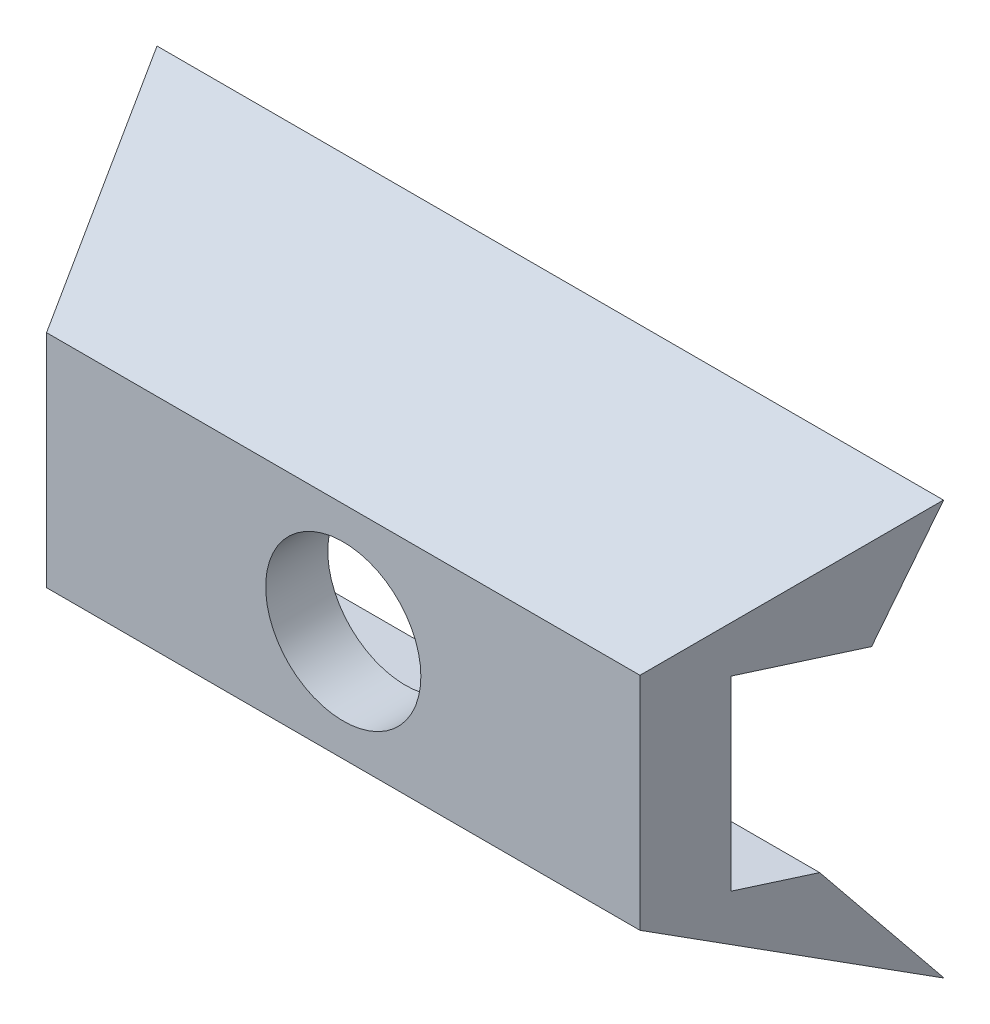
ISO-10303-21;
HEADER;
FILE_DESCRIPTION(('STEP AP214'),'2;1');
FILE_NAME('part.step','',(''),(''),'','','');
FILE_SCHEMA(('AUTOMOTIVE_DESIGN { 1 0 10303 214 1 1 1 1 }'));
ENDSEC;
DATA;
#1=APPLICATION_CONTEXT('core data for automotive mechanical design processes');
#2=APPLICATION_PROTOCOL_DEFINITION('international standard','automotive_design',2000,#1);
#3=PRODUCT_CONTEXT('',#1,'mechanical');
#4=PRODUCT('Part','Part','',(#3));
#5=PRODUCT_RELATED_PRODUCT_CATEGORY('part','',(#4));
#6=PRODUCT_DEFINITION_FORMATION('','',#4);
#7=PRODUCT_DEFINITION_CONTEXT('part definition',#1,'design');
#8=PRODUCT_DEFINITION('design','',#6,#7);
#9=PRODUCT_DEFINITION_SHAPE('','',#8);
#10=(LENGTH_UNIT() NAMED_UNIT(*) SI_UNIT(.MILLI.,.METRE.));
#11=(NAMED_UNIT(*) PLANE_ANGLE_UNIT() SI_UNIT($,.RADIAN.));
#12=(NAMED_UNIT(*) SI_UNIT($,.STERADIAN.) SOLID_ANGLE_UNIT());
#13=UNCERTAINTY_MEASURE_WITH_UNIT(LENGTH_MEASURE(1.E-05),#10,'distance_accuracy_value','');
#14=(GEOMETRIC_REPRESENTATION_CONTEXT(3) GLOBAL_UNCERTAINTY_ASSIGNED_CONTEXT((#13)) GLOBAL_UNIT_ASSIGNED_CONTEXT((#10,
#11,#12)) REPRESENTATION_CONTEXT('',''));
#15=CARTESIAN_POINT('',(0.,0.,0.));
#16=DIRECTION('',(0.,0.,1.));
#17=DIRECTION('',(1.,0.,0.));
#18=AXIS2_PLACEMENT_3D('',#15,#16,#17);
#19=CARTESIAN_POINT('',(-38.,-20.,0.));
#20=DIRECTION('',(0.,0.,1.));
#21=DIRECTION('',(1.,0.,0.));
#22=AXIS2_PLACEMENT_3D('',#19,#20,#21);
#23=PLANE('',#22);
#24=DIRECTION('',(0.,1.,0.));
#25=VECTOR('',#24,1.);
#26=CARTESIAN_POINT('',(38.,20.,0.));
#27=LINE('',#26,#25);
#28=CARTESIAN_POINT('',(38.,19.9746411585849,0.));
#29=VERTEX_POINT('',#28);
#30=CARTESIAN_POINT('',(38.,20.,0.));
#31=VERTEX_POINT('',#30);
#32=EDGE_CURVE('E132',#29,#31,#27,.T.);
#33=ORIENTED_EDGE('',*,*,#32,.F.);
#34=DIRECTION('',(-1.,0.,0.));
#35=VECTOR('',#34,1.);
#36=CARTESIAN_POINT('',(-38.,19.9746411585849,0.));
#37=LINE('',#36,#35);
#38=CARTESIAN_POINT('',(-38.,19.9746411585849,0.));
#39=VERTEX_POINT('',#38);
#40=EDGE_CURVE('E114',#29,#39,#37,.T.);
#41=ORIENTED_EDGE('',*,*,#40,.T.);
#42=DIRECTION('',(0.,-1.,0.));
#43=VECTOR('',#42,1.);
#44=CARTESIAN_POINT('',(-38.,20.,0.));
#45=LINE('',#44,#43);
#46=CARTESIAN_POINT('',(-38.,20.,0.));
#47=VERTEX_POINT('',#46);
#48=EDGE_CURVE('E143',#47,#39,#45,.T.);
#49=ORIENTED_EDGE('',*,*,#48,.F.);
#50=DIRECTION('',(-1.,0.,0.));
#51=VECTOR('',#50,1.);
#52=CARTESIAN_POINT('',(-38.,20.,0.));
#53=LINE('',#52,#51);
#54=EDGE_CURVE('E138',#31,#47,#53,.T.);
#55=ORIENTED_EDGE('',*,*,#54,.F.);
#56=EDGE_LOOP('',(#33,#41,#49,#55));
#57=FACE_BOUND('',#56,.T.);
#58=ADVANCED_FACE('F35',(#57),#23,.F.);
#59=CARTESIAN_POINT('',(-38.,20.,0.));
#60=DIRECTION('',(-0.90630778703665,0.,0.4226182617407));
#61=DIRECTION('',(0.4226182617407,0.,0.90630778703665));
#62=AXIS2_PLACEMENT_3D('',#59,#60,#61);
#63=PLANE('',#62);
#64=ORIENTED_EDGE('',*,*,#48,.T.);
#65=DIRECTION('',(-0.181581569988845,0.902991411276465,-0.389402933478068));
#66=VECTOR('',#65,1.);
#67=CARTESIAN_POINT('',(-38.0041580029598,19.9953185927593,-0.00891686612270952));
#68=LINE('',#67,#66);
#69=CARTESIAN_POINT('',(-35.7931212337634,9.00000000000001,4.73266678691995));
#70=VERTEX_POINT('',#69);
#71=EDGE_CURVE('E121',#39,#70,#68,.F.);
#72=ORIENTED_EDGE('',*,*,#71,.T.);
#73=DIRECTION('',(-0.4226182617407,0.,-0.90630778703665));
#74=VECTOR('',#73,1.);
#75=CARTESIAN_POINT('',(-38.,9.00000000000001,0.));
#76=LINE('',#75,#74);
#77=CARTESIAN_POINT('',(-31.47169278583,9.00000000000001,14.));
#78=VERTEX_POINT('',#77);
#79=EDGE_CURVE('E196',#70,#78,#76,.F.);
#80=ORIENTED_EDGE('',*,*,#79,.T.);
#81=DIRECTION('',(0.,1.,0.));
#82=VECTOR('',#81,1.);
#83=CARTESIAN_POINT('',(-31.47169278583,20.,14.));
#84=LINE('',#83,#82);
#85=CARTESIAN_POINT('',(-31.47169278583,-8.99999999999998,14.));
#86=VERTEX_POINT('',#85);
#87=EDGE_CURVE('E191',#78,#86,#84,.F.);
#88=ORIENTED_EDGE('',*,*,#87,.T.);
#89=DIRECTION('',(0.4226182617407,0.,0.90630778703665));
#90=VECTOR('',#89,1.);
#91=CARTESIAN_POINT('',(-38.,-8.99999999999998,0.));
#92=LINE('',#91,#90);
#93=CARTESIAN_POINT('',(-34.195833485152,-8.99999999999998,8.15806141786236));
#94=VERTEX_POINT('',#93);
#95=EDGE_CURVE('E194',#86,#94,#92,.F.);
#96=ORIENTED_EDGE('',*,*,#95,.T.);
#97=DIRECTION('',(0.268287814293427,0.772657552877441,0.575345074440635));
#98=VECTOR('',#97,1.);
#99=CARTESIAN_POINT('',(-29.717370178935,3.89778482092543,17.7621569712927));
#100=LINE('',#99,#98);
#101=CARTESIAN_POINT('',(-38.,-19.9558385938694,0.));
#102=VERTEX_POINT('',#101);
#103=EDGE_CURVE('E135',#94,#102,#100,.F.);
#104=ORIENTED_EDGE('',*,*,#103,.T.);
#105=CARTESIAN_POINT('',(-38.,-20.,0.));
#106=VERTEX_POINT('',#105);
#107=EDGE_CURVE('E198',#102,#106,#45,.T.);
#108=ORIENTED_EDGE('',*,*,#107,.T.);
#109=DIRECTION('',(-0.389281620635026,-0.389281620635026,-0.834817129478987));
#110=VECTOR('',#109,1.);
#111=CARTESIAN_POINT('',(-38.,-20.,0.));
#112=LINE('',#111,#110);
#113=CARTESIAN_POINT('',(-28.6738468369,-10.6738468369,20.));
#114=VERTEX_POINT('',#113);
#115=EDGE_CURVE('E149',#114,#106,#112,.T.);
#116=ORIENTED_EDGE('',*,*,#115,.F.);
#117=DIRECTION('',(0.,1.,0.));
#118=VECTOR('',#117,1.);
#119=CARTESIAN_POINT('',(-28.6738468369,20.,20.));
#120=LINE('',#119,#118);
#121=CARTESIAN_POINT('',(-28.6738468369,10.6738468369,20.));
#122=VERTEX_POINT('',#121);
#123=EDGE_CURVE('E148',#122,#114,#120,.F.);
#124=ORIENTED_EDGE('',*,*,#123,.F.);
#125=DIRECTION('',(-0.389281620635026,0.389281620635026,-0.834817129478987));
#126=VECTOR('',#125,1.);
#127=CARTESIAN_POINT('',(-38.,20.,0.));
#128=LINE('',#127,#126);
#129=EDGE_CURVE('E153',#122,#47,#128,.T.);
#130=ORIENTED_EDGE('',*,*,#129,.T.);
#131=EDGE_LOOP('',(#64,#72,#80,#88,#96,#104,#108,#116,#124,#130));
#132=FACE_BOUND('',#131,.T.);
#133=ADVANCED_FACE('F203',(#132),#63,.T.);
#134=CARTESIAN_POINT('',(-38.,-20.,0.));
#135=DIRECTION('',(0.,-0.90630778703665,0.4226182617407));
#136=DIRECTION('',(0.,-0.4226182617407,-0.90630778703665));
#137=AXIS2_PLACEMENT_3D('',#134,#135,#136);
#138=PLANE('',#137);
#139=DIRECTION('',(1.,0.,0.));
#140=VECTOR('',#139,1.);
#141=CARTESIAN_POINT('',(-38.,-20.,0.));
#142=LINE('',#141,#140);
#143=CARTESIAN_POINT('',(38.,-20.,0.));
#144=VERTEX_POINT('',#143);
#145=EDGE_CURVE('E140',#106,#144,#142,.T.);
#146=ORIENTED_EDGE('',*,*,#145,.T.);
#147=DIRECTION('',(0.389281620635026,-0.389281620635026,-0.834817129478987));
#148=VECTOR('',#147,1.);
#149=CARTESIAN_POINT('',(31.9383927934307,-13.9383927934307,12.9991586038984));
#150=LINE('',#149,#148);
#151=CARTESIAN_POINT('',(28.6738468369,-10.6738468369,20.));
#152=VERTEX_POINT('',#151);
#153=EDGE_CURVE('E152',#152,#144,#150,.T.);
#154=ORIENTED_EDGE('',*,*,#153,.F.);
#155=DIRECTION('',(-1.,0.,0.));
#156=VECTOR('',#155,1.);
#157=CARTESIAN_POINT('',(-38.,-10.6738468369,20.));
#158=LINE('',#157,#156);
#159=EDGE_CURVE('E161',#114,#152,#158,.F.);
#160=ORIENTED_EDGE('',*,*,#159,.F.);
#161=ORIENTED_EDGE('',*,*,#115,.T.);
#162=EDGE_LOOP('',(#146,#154,#160,#161));
#163=FACE_BOUND('',#162,.T.);
#164=ADVANCED_FACE('F37',(#163),#138,.T.);
#165=CARTESIAN_POINT('',(38.,20.,0.));
#166=DIRECTION('',(0.90630778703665,0.,0.4226182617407));
#167=DIRECTION('',(0.4226182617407,0.,-0.90630778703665));
#168=AXIS2_PLACEMENT_3D('',#165,#166,#167);
#169=PLANE('',#168);
#170=DIRECTION('',(-0.4226182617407,0.,0.90630778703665));
#171=VECTOR('',#170,1.);
#172=CARTESIAN_POINT('',(38.,9.00000000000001,0.));
#173=LINE('',#172,#171);
#174=CARTESIAN_POINT('',(31.47169278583,9.00000000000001,14.));
#175=VERTEX_POINT('',#174);
#176=CARTESIAN_POINT('',(35.7931212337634,9.00000000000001,4.73266678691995));
#177=VERTEX_POINT('',#176);
#178=EDGE_CURVE('E11',#175,#177,#173,.F.);
#179=ORIENTED_EDGE('',*,*,#178,.T.);
#180=DIRECTION('',(-0.181581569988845,-0.902991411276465,0.389402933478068));
#181=VECTOR('',#180,1.);
#182=CARTESIAN_POINT('',(38.0041580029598,19.9953185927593,-0.00891686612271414));
#183=LINE('',#182,#181);
#184=EDGE_CURVE('E118',#177,#29,#183,.F.);
#185=ORIENTED_EDGE('',*,*,#184,.T.);
#186=ORIENTED_EDGE('',*,*,#32,.T.);
#187=DIRECTION('',(0.389281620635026,0.389281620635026,-0.834817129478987));
#188=VECTOR('',#187,1.);
#189=CARTESIAN_POINT('',(26.4829463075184,8.48294630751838,24.698401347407));
#190=LINE('',#189,#188);
#191=CARTESIAN_POINT('',(28.6738468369,10.6738468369,20.));
#192=VERTEX_POINT('',#191);
#193=EDGE_CURVE('E156',#192,#31,#190,.T.);
#194=ORIENTED_EDGE('',*,*,#193,.F.);
#195=DIRECTION('',(0.,-1.,0.));
#196=VECTOR('',#195,1.);
#197=CARTESIAN_POINT('',(28.6738468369,20.,20.));
#198=LINE('',#197,#196);
#199=EDGE_CURVE('E163',#152,#192,#198,.F.);
#200=ORIENTED_EDGE('',*,*,#199,.F.);
#201=ORIENTED_EDGE('',*,*,#153,.T.);
#202=CARTESIAN_POINT('',(38.,-19.9558385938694,0.));
#203=VERTEX_POINT('',#202);
#204=EDGE_CURVE('E139',#144,#203,#27,.T.);
#205=ORIENTED_EDGE('',*,*,#204,.T.);
#206=DIRECTION('',(0.268287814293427,-0.772657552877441,-0.575345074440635));
#207=VECTOR('',#206,1.);
#208=CARTESIAN_POINT('',(29.717370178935,3.89778482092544,17.7621569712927));
#209=LINE('',#208,#207);
#210=CARTESIAN_POINT('',(34.1958334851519,-8.99999999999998,8.15806141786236));
#211=VERTEX_POINT('',#210);
#212=EDGE_CURVE('E51',#203,#211,#209,.F.);
#213=ORIENTED_EDGE('',*,*,#212,.T.);
#214=DIRECTION('',(0.4226182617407,0.,-0.90630778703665));
#215=VECTOR('',#214,1.);
#216=CARTESIAN_POINT('',(38.,-8.99999999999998,0.));
#217=LINE('',#216,#215);
#218=CARTESIAN_POINT('',(31.47169278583,-8.99999999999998,14.));
#219=VERTEX_POINT('',#218);
#220=EDGE_CURVE('E44',#211,#219,#217,.F.);
#221=ORIENTED_EDGE('',*,*,#220,.T.);
#222=DIRECTION('',(0.,-1.,0.));
#223=VECTOR('',#222,1.);
#224=CARTESIAN_POINT('',(31.47169278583,20.,14.));
#225=LINE('',#224,#223);
#226=EDGE_CURVE('E126',#219,#175,#225,.F.);
#227=ORIENTED_EDGE('',*,*,#226,.T.);
#228=EDGE_LOOP('',(#179,#185,#186,#194,#200,#201,#205,#213,#221,#227));
#229=FACE_BOUND('',#228,.T.);
#230=ADVANCED_FACE('F130',(#229),#169,.T.);
#231=CARTESIAN_POINT('',(-38.,20.,0.));
#232=DIRECTION('',(0.,0.90630778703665,0.4226182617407));
#233=DIRECTION('',(0.,-0.4226182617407,0.90630778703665));
#234=AXIS2_PLACEMENT_3D('',#231,#232,#233);
#235=PLANE('',#234);
#236=ORIENTED_EDGE('',*,*,#54,.T.);
#237=ORIENTED_EDGE('',*,*,#129,.F.);
#238=DIRECTION('',(1.,0.,0.));
#239=VECTOR('',#238,1.);
#240=CARTESIAN_POINT('',(-38.,10.6738468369,20.));
#241=LINE('',#240,#239);
#242=EDGE_CURVE('E59',#192,#122,#241,.F.);
#243=ORIENTED_EDGE('',*,*,#242,.F.);
#244=ORIENTED_EDGE('',*,*,#193,.T.);
#245=EDGE_LOOP('',(#236,#237,#243,#244));
#246=FACE_BOUND('',#245,.T.);
#247=ADVANCED_FACE('F213',(#246),#235,.T.);
#248=CARTESIAN_POINT('',(-38.,-20.,20.));
#249=DIRECTION('',(0.,0.,1.));
#250=DIRECTION('',(1.,0.,0.));
#251=AXIS2_PLACEMENT_3D('',#248,#249,#250);
#252=PLANE('',#251);
#253=CARTESIAN_POINT('',(0.,0.,20.));
#254=DIRECTION('',(0.,0.,1.));
#255=DIRECTION('',(1.,0.,0.));
#256=AXIS2_PLACEMENT_3D('',#253,#254,#255);
#257=CIRCLE('',#256,7.5);
#258=CARTESIAN_POINT('',(7.5,0.,20.));
#259=VERTEX_POINT('',#258);
#260=EDGE_CURVE('E256',#259,#259,#257,.T.);
#261=ORIENTED_EDGE('',*,*,#260,.F.);
#262=EDGE_LOOP('',(#261));
#263=FACE_BOUND('',#262,.T.);
#264=ORIENTED_EDGE('',*,*,#123,.T.);
#265=ORIENTED_EDGE('',*,*,#159,.T.);
#266=ORIENTED_EDGE('',*,*,#199,.T.);
#267=ORIENTED_EDGE('',*,*,#242,.T.);
#268=EDGE_LOOP('',(#264,#265,#266,#267));
#269=FACE_BOUND('',#268,.T.);
#270=ADVANCED_FACE('F211',(#263,#269),#252,.T.);
#271=ORIENTED_EDGE('',*,*,#107,.F.);
#272=DIRECTION('',(1.,0.,0.));
#273=VECTOR('',#272,1.);
#274=CARTESIAN_POINT('',(-38.,-19.9558385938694,0.));
#275=LINE('',#274,#273);
#276=EDGE_CURVE('E127',#102,#203,#275,.T.);
#277=ORIENTED_EDGE('',*,*,#276,.T.);
#278=ORIENTED_EDGE('',*,*,#204,.F.);
#279=ORIENTED_EDGE('',*,*,#145,.F.);
#280=EDGE_LOOP('',(#271,#277,#278,#279));
#281=FACE_BOUND('',#280,.T.);
#282=ADVANCED_FACE('F207',(#281),#23,.F.);
#283=CARTESIAN_POINT('',(-38.,9.00000000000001,14.));
#284=DIRECTION('',(0.,1.,0.));
#285=DIRECTION('',(0.,0.,1.));
#286=AXIS2_PLACEMENT_3D('',#283,#284,#285);
#287=PLANE('',#286);
#288=DIRECTION('',(1.,0.,0.));
#289=VECTOR('',#288,1.);
#290=CARTESIAN_POINT('',(-38.,9.00000000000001,4.73266678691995));
#291=LINE('',#290,#289);
#292=EDGE_CURVE('E179',#70,#177,#291,.T.);
#293=ORIENTED_EDGE('',*,*,#292,.T.);
#294=ORIENTED_EDGE('',*,*,#178,.F.);
#295=DIRECTION('',(1.,0.,0.));
#296=VECTOR('',#295,1.);
#297=CARTESIAN_POINT('',(-38.,9.00000000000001,14.));
#298=LINE('',#297,#296);
#299=EDGE_CURVE('E182',#78,#175,#298,.T.);
#300=ORIENTED_EDGE('',*,*,#299,.F.);
#301=ORIENTED_EDGE('',*,*,#79,.F.);
#302=EDGE_LOOP('',(#293,#294,#300,#301));
#303=FACE_BOUND('',#302,.T.);
#304=ADVANCED_FACE('F229',(#303),#287,.F.);
#305=CARTESIAN_POINT('',(-38.,-8.99999999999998,14.));
#306=DIRECTION('',(0.,-1.,0.));
#307=DIRECTION('',(0.,0.,-1.));
#308=AXIS2_PLACEMENT_3D('',#305,#306,#307);
#309=PLANE('',#308);
#310=DIRECTION('',(1.,0.,0.));
#311=VECTOR('',#310,1.);
#312=CARTESIAN_POINT('',(-38.,-8.99999999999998,14.));
#313=LINE('',#312,#311);
#314=EDGE_CURVE('E176',#86,#219,#313,.T.);
#315=ORIENTED_EDGE('',*,*,#314,.T.);
#316=ORIENTED_EDGE('',*,*,#220,.F.);
#317=DIRECTION('',(1.,0.,0.));
#318=VECTOR('',#317,1.);
#319=CARTESIAN_POINT('',(-38.,-8.99999999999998,8.15806141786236));
#320=LINE('',#319,#318);
#321=EDGE_CURVE('E173',#94,#211,#320,.T.);
#322=ORIENTED_EDGE('',*,*,#321,.F.);
#323=ORIENTED_EDGE('',*,*,#95,.F.);
#324=EDGE_LOOP('',(#315,#316,#322,#323));
#325=FACE_BOUND('',#324,.T.);
#326=ADVANCED_FACE('F172',(#325),#309,.F.);
#327=CARTESIAN_POINT('',(-38.,9.00000000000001,14.));
#328=DIRECTION('',(0.,0.,1.));
#329=DIRECTION('',(1.,0.,0.));
#330=AXIS2_PLACEMENT_3D('',#327,#328,#329);
#331=PLANE('',#330);
#332=CARTESIAN_POINT('',(0.,0.,14.));
#333=DIRECTION('',(0.,0.,1.));
#334=DIRECTION('',(1.,0.,0.));
#335=AXIS2_PLACEMENT_3D('',#332,#333,#334);
#336=CIRCLE('',#335,7.5);
#337=CARTESIAN_POINT('',(7.5,0.,14.));
#338=VERTEX_POINT('',#337);
#339=EDGE_CURVE('E39',#338,#338,#336,.T.);
#340=ORIENTED_EDGE('',*,*,#339,.T.);
#341=EDGE_LOOP('',(#340));
#342=FACE_BOUND('',#341,.T.);
#343=ORIENTED_EDGE('',*,*,#299,.T.);
#344=ORIENTED_EDGE('',*,*,#226,.F.);
#345=ORIENTED_EDGE('',*,*,#314,.F.);
#346=ORIENTED_EDGE('',*,*,#87,.F.);
#347=EDGE_LOOP('',(#343,#344,#345,#346));
#348=FACE_BOUND('',#347,.T.);
#349=ADVANCED_FACE('F238',(#342,#348),#331,.F.);
#350=CARTESIAN_POINT('',(-38.,9.00000000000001,4.73266678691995));
#351=DIRECTION('',(0.,0.395985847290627,0.918256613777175));
#352=DIRECTION('',(0.,-0.918256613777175,0.395985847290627));
#353=AXIS2_PLACEMENT_3D('',#350,#351,#352);
#354=PLANE('',#353);
#355=ORIENTED_EDGE('',*,*,#40,.F.);
#356=ORIENTED_EDGE('',*,*,#184,.F.);
#357=ORIENTED_EDGE('',*,*,#292,.F.);
#358=ORIENTED_EDGE('',*,*,#71,.F.);
#359=EDGE_LOOP('',(#355,#356,#357,#358));
#360=FACE_BOUND('',#359,.T.);
#361=ADVANCED_FACE('F116',(#360),#354,.F.);
#362=CARTESIAN_POINT('',(-38.,-8.99999999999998,8.15806141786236));
#363=DIRECTION('',(0.,-0.597240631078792,0.802062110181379));
#364=DIRECTION('',(0.,-0.802062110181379,-0.597240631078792));
#365=AXIS2_PLACEMENT_3D('',#362,#363,#364);
#366=PLANE('',#365);
#367=ORIENTED_EDGE('',*,*,#321,.T.);
#368=ORIENTED_EDGE('',*,*,#212,.F.);
#369=ORIENTED_EDGE('',*,*,#276,.F.);
#370=ORIENTED_EDGE('',*,*,#103,.F.);
#371=EDGE_LOOP('',(#367,#368,#369,#370));
#372=FACE_BOUND('',#371,.T.);
#373=ADVANCED_FACE('F177',(#372),#366,.F.);
#374=CARTESIAN_POINT('',(0.,0.,0.));
#375=DIRECTION('',(0.,0.,1.));
#376=DIRECTION('',(1.,0.,0.));
#377=AXIS2_PLACEMENT_3D('',#374,#375,#376);
#378=CYLINDRICAL_SURFACE('',#377,7.5);
#379=ORIENTED_EDGE('',*,*,#260,.T.);
#380=EDGE_LOOP('',(#379));
#381=FACE_BOUND('',#380,.T.);
#382=ORIENTED_EDGE('',*,*,#339,.F.);
#383=EDGE_LOOP('',(#382));
#384=FACE_BOUND('',#383,.T.);
#385=ADVANCED_FACE('F246',(#381,#384),#378,.F.);
#386=CLOSED_SHELL('',(#58,#133,#164,#230,#247,#270,#282,#304,#326,#349,#361,#373,#385));
#387=MANIFOLD_SOLID_BREP('B2',#386);
#388=ADVANCED_BREP_SHAPE_REPRESENTATION('',(#18,#387),#14);
#389=SHAPE_DEFINITION_REPRESENTATION(#9,#388);
ENDSEC;
END-ISO-10303-21;
